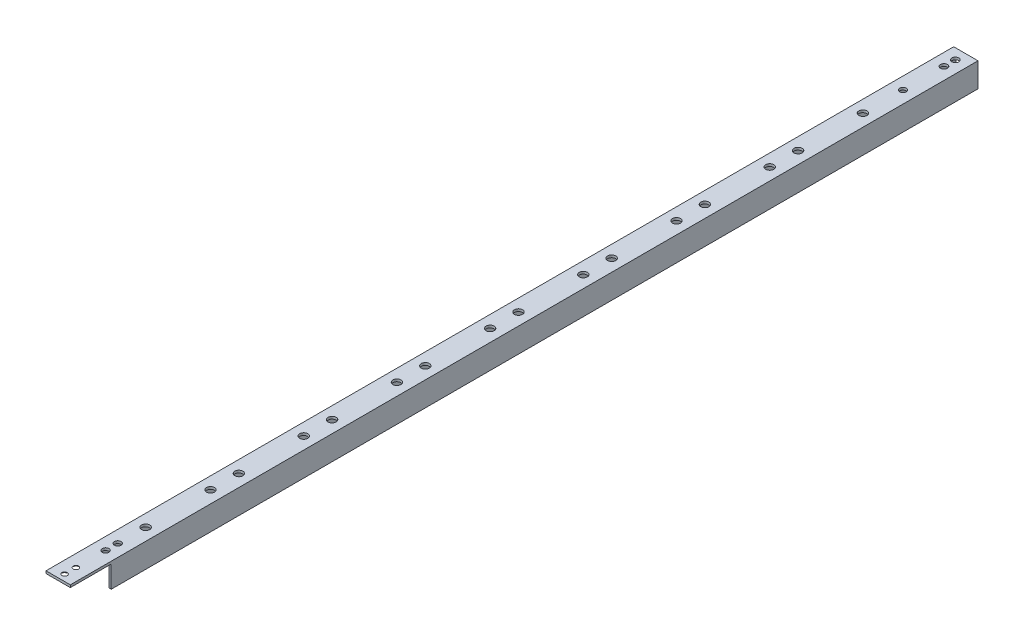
from build123d import *

# Parameters (mm, degrees)
SKETCH2_W                                           = 30
SKETCH2_H                                           = 30
BOSS_EXTRUDE1_DEPTH                                 = 560
SKETCH3_W                                           = 24
SKETCH3_H                                           = 27
CUT_EXTRUDE1_DEPTH                                  = 1121.200874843
F_10_0MM_DOWEL_HOLE1_D                              = 10
SKETCH9_R                                           = 4.25
SKETCH9_R_2                                         = 3.1
CUT_EXTRUDE2_DEPTH                                  = 561.851138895
SKETCH10_W                                          = 3
SKETCH10_H                                          = 27
CUT_EXTRUDE3_DEPTH                                  = 50.5
SKETCH12_R                                          = 4.1
CUT_EXTRUDE4_DEPTH                                  = 10
SKETCH13_R                                          = 4.1
CUT_EXTRUDE5_DEPTH                                  = 10
CSK_FOR_M6_COUNTERSUNK_FLAT_HEAD_SCREW1_D           = 6.6
CSK_FOR_M6_COUNTERSUNK_FLAT_HEAD_SCREW1_DEPTH       = 12.4
CSK_FOR_M6_COUNTERSUNK_FLAT_HEAD_SCREW1_CSINK_D     = 12.6
CSK_FOR_M6_COUNTERSUNK_FLAT_HEAD_SCREW1_CSINK_ANGLE = 90
CSK_FOR_M6_COUNTERSUNK_FLAT_HEAD_SCREW1_TIP         = 1.982840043


with BuildPart() as part:
    # Sketch2 → Boss-Extrude1 (new, symmetric)
    with BuildSketch(Plane.XY):
        Rectangle(SKETCH2_W, SKETCH2_H)
    extrude(amount=BOSS_EXTRUDE1_DEPTH, both=True)

    # Sketch3 → Cut-Extrude1 (cut, through all)
    with BuildSketch(Plane.XY.offset(560)):
        with Locations((0, -1.5)):
            Rectangle(SKETCH3_W, SKETCH3_H)
    extrude(amount=-CUT_EXTRUDE1_DEPTH, mode=Mode.SUBTRACT)

    # 10.0mm Dowel Hole1 (through all)
    with Locations(Plane(origin=(0, 15, 0), x_dir=(1, 0, 0), z_dir=(0, 1, 0))):
        with Locations((0, -452), (0, -372), (0, -337), (0, -257), (0, -222), (0, -142), (0, -107), (0, -27), (0, 8), (0, 88), (0, 123), (0, 203), (0, 238), (0, 318), (0, 353), (0, 433)):
            Hole(F_10_0MM_DOWEL_HOLE1_D / 2)

    # Sketch9 → Cut-Extrude2 (cut, through all)
    with BuildSketch(Plane(origin=(0, 12, 0), x_dir=(-1, 0, 0), z_dir=(0, -1, 0))):
        with Locations(Location((0, 547, 0), (0, 0, 180))):
            Circle(SKETCH9_R)
        with Locations(Location((0, 533, 0), (0, 0, 180))):
            Circle(SKETCH9_R)
        with Locations(Location((0, -538, 0), (0, 0, 180))):
            Circle(SKETCH9_R_2)
        with Locations(Location((0, -552, 0), (0, 0, 180))):
            Circle(SKETCH9_R_2)
    extrude(amount=-CUT_EXTRUDE2_DEPTH, mode=Mode.SUBTRACT)

    # Sketch10 → Cut-Extrude3 (cut)
    with BuildSketch(Plane.XY.offset(560)):
        with Locations((-13.5, -1.5)):
            Rectangle(SKETCH10_W, SKETCH10_H)
        with Locations((13.5, -1.5)):
            Rectangle(SKETCH10_W, SKETCH10_H)
    extrude(amount=-CUT_EXTRUDE3_DEPTH, mode=Mode.SUBTRACT)

    # Sketch12 → Cut-Extrude4 (cut)
    with BuildSketch(Plane(origin=(0, 12, 0), x_dir=(-1, 0, 0), z_dir=(0, -1, 0))):
        with Locations(Location((0, -501.5, 0), (0, 0, 180))):
            Circle(SKETCH12_R)
        with Locations(Location((0, -486.5, 0), (0, 0, 180))):
            Circle(SKETCH12_R)
    extrude(amount=-CUT_EXTRUDE4_DEPTH, mode=Mode.SUBTRACT)

    # Sketch13 → Cut-Extrude5 (cut)
    with BuildSketch(Plane(origin=(0, 12, 0), x_dir=(-1, 0, 0), z_dir=(0, -1, 0))):
        with Locations(Location((0, 482.5, 0), (0, 0, 180))):
            Circle(SKETCH13_R)
    extrude(amount=-CUT_EXTRUDE5_DEPTH, mode=Mode.SUBTRACT)

    # CSK for M6 Countersunk Flat Head Screw1
    with Locations(Plane(origin=(0, 12, 538), x_dir=(-1, 0, 0), z_dir=(0, -1, 0))):
        with Locations((0, 0), (0, -14)):
            CounterSinkHole(CSK_FOR_M6_COUNTERSUNK_FLAT_HEAD_SCREW1_D / 2, CSK_FOR_M6_COUNTERSUNK_FLAT_HEAD_SCREW1_CSINK_D / 2, depth=CSK_FOR_M6_COUNTERSUNK_FLAT_HEAD_SCREW1_DEPTH, counter_sink_angle=CSK_FOR_M6_COUNTERSUNK_FLAT_HEAD_SCREW1_CSINK_ANGLE)
            with Locations((0, 0, -(CSK_FOR_M6_COUNTERSUNK_FLAT_HEAD_SCREW1_DEPTH + CSK_FOR_M6_COUNTERSUNK_FLAT_HEAD_SCREW1_TIP / 2))):  # 118° drill point
                Cone(0, CSK_FOR_M6_COUNTERSUNK_FLAT_HEAD_SCREW1_D / 2, CSK_FOR_M6_COUNTERSUNK_FLAT_HEAD_SCREW1_TIP, mode=Mode.SUBTRACT)


solid = part.part
